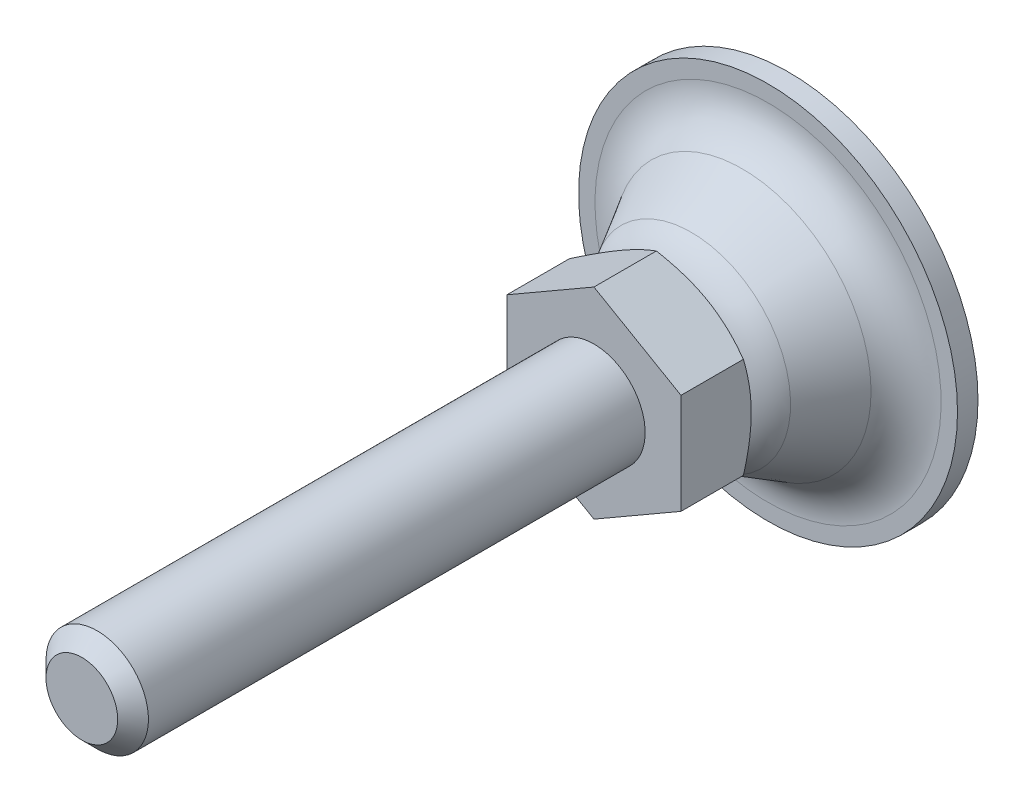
ISO-10303-21;
HEADER;
FILE_DESCRIPTION(('STEP AP214'),'2;1');
FILE_NAME('part.step','',(''),(''),'','','');
FILE_SCHEMA(('AUTOMOTIVE_DESIGN { 1 0 10303 214 1 1 1 1 }'));
ENDSEC;
DATA;
#1=APPLICATION_CONTEXT('core data for automotive mechanical design processes');
#2=APPLICATION_PROTOCOL_DEFINITION('international standard','automotive_design',2000,#1);
#3=PRODUCT_CONTEXT('',#1,'mechanical');
#4=PRODUCT('Part','Part','',(#3));
#5=PRODUCT_RELATED_PRODUCT_CATEGORY('part','',(#4));
#6=PRODUCT_DEFINITION_FORMATION('','',#4);
#7=PRODUCT_DEFINITION_CONTEXT('part definition',#1,'design');
#8=PRODUCT_DEFINITION('design','',#6,#7);
#9=PRODUCT_DEFINITION_SHAPE('','',#8);
#10=(LENGTH_UNIT() NAMED_UNIT(*) SI_UNIT(.MILLI.,.METRE.));
#11=(NAMED_UNIT(*) PLANE_ANGLE_UNIT() SI_UNIT($,.RADIAN.));
#12=(NAMED_UNIT(*) SI_UNIT($,.STERADIAN.) SOLID_ANGLE_UNIT());
#13=UNCERTAINTY_MEASURE_WITH_UNIT(LENGTH_MEASURE(1.E-05),#10,'distance_accuracy_value','');
#14=(GEOMETRIC_REPRESENTATION_CONTEXT(3) GLOBAL_UNCERTAINTY_ASSIGNED_CONTEXT((#13)) GLOBAL_UNIT_ASSIGNED_CONTEXT((#10,
#11,#12)) REPRESENTATION_CONTEXT('',''));
#15=CARTESIAN_POINT('',(0.,0.,0.));
#16=DIRECTION('',(0.,0.,1.));
#17=DIRECTION('',(1.,0.,0.));
#18=AXIS2_PLACEMENT_3D('',#15,#16,#17);
#19=CARTESIAN_POINT('',(-9.25,16.0214699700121,1.99999918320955));
#20=DIRECTION('',(0.,0.,-1.));
#21=DIRECTION('',(-0.5,0.866025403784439,0.));
#22=AXIS2_PLACEMENT_3D('',#19,#20,#21);
#23=PLANE('',#22);
#24=CARTESIAN_POINT('',(0.,0.,1.99999918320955));
#25=DIRECTION('',(0.,0.,1.));
#26=DIRECTION('',(0.5,-0.866025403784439,0.));
#27=AXIS2_PLACEMENT_3D('',#24,#25,#26);
#28=CIRCLE('',#27,16.8976413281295);
#29=CARTESIAN_POINT('',(8.44882066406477,-14.633786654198,1.99999918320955));
#30=VERTEX_POINT('',#29);
#31=EDGE_CURVE('E108',#30,#30,#28,.T.);
#32=ORIENTED_EDGE('',*,*,#31,.F.);
#33=EDGE_LOOP('',(#32));
#34=FACE_BOUND('',#33,.T.);
#35=CARTESIAN_POINT('',(0.,0.,2.));
#36=DIRECTION('',(0.,0.,1.));
#37=DIRECTION('',(1.,0.,0.));
#38=AXIS2_PLACEMENT_3D('',#35,#36,#37);
#39=CIRCLE('',#38,18.5);
#40=CARTESIAN_POINT('',(18.5,0.,2.));
#41=VERTEX_POINT('',#40);
#42=EDGE_CURVE('E245',#41,#41,#39,.T.);
#43=ORIENTED_EDGE('',*,*,#42,.T.);
#44=EDGE_LOOP('',(#43));
#45=FACE_BOUND('',#44,.T.);
#46=ADVANCED_FACE('F14',(#34,#45),#23,.F.);
#47=CARTESIAN_POINT('',(0.,0.,19.));
#48=DIRECTION('',(0.,0.,1.));
#49=DIRECTION('',(0.5,-0.866025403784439,0.));
#50=AXIS2_PLACEMENT_3D('',#47,#48,#49);
#51=PLANE('',#50);
#52=DIRECTION('',(0.,1.,0.));
#53=VECTOR('',#52,1.);
#54=CARTESIAN_POINT('',(8.5,-4.90747728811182,19.));
#55=LINE('',#54,#53);
#56=CARTESIAN_POINT('',(8.5,-4.90747728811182,19.));
#57=VERTEX_POINT('',#56);
#58=CARTESIAN_POINT('',(8.5,4.90747728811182,19.));
#59=VERTEX_POINT('',#58);
#60=EDGE_CURVE('E179',#57,#59,#55,.T.);
#61=ORIENTED_EDGE('',*,*,#60,.T.);
#62=DIRECTION('',(-0.866025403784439,0.5,0.));
#63=VECTOR('',#62,1.);
#64=CARTESIAN_POINT('',(8.5,4.90747728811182,19.));
#65=LINE('',#64,#63);
#66=CARTESIAN_POINT('',(0.,9.81495457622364,19.));
#67=VERTEX_POINT('',#66);
#68=EDGE_CURVE('E181',#59,#67,#65,.T.);
#69=ORIENTED_EDGE('',*,*,#68,.T.);
#70=DIRECTION('',(-0.866025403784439,-0.5,0.));
#71=VECTOR('',#70,1.);
#72=CARTESIAN_POINT('',(0.,9.81495457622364,19.));
#73=LINE('',#72,#71);
#74=CARTESIAN_POINT('',(-8.5,4.90747728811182,19.));
#75=VERTEX_POINT('',#74);
#76=EDGE_CURVE('E183',#67,#75,#73,.T.);
#77=ORIENTED_EDGE('',*,*,#76,.T.);
#78=DIRECTION('',(0.,-1.,0.));
#79=VECTOR('',#78,1.);
#80=CARTESIAN_POINT('',(-8.5,4.90747728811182,19.));
#81=LINE('',#80,#79);
#82=CARTESIAN_POINT('',(-8.5,-4.90747728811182,19.));
#83=VERTEX_POINT('',#82);
#84=EDGE_CURVE('E185',#75,#83,#81,.T.);
#85=ORIENTED_EDGE('',*,*,#84,.T.);
#86=DIRECTION('',(0.866025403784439,-0.5,0.));
#87=VECTOR('',#86,1.);
#88=CARTESIAN_POINT('',(-8.5,-4.90747728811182,19.));
#89=LINE('',#88,#87);
#90=CARTESIAN_POINT('',(0.,-9.81495457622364,19.));
#91=VERTEX_POINT('',#90);
#92=EDGE_CURVE('E187',#83,#91,#89,.T.);
#93=ORIENTED_EDGE('',*,*,#92,.T.);
#94=DIRECTION('',(0.866025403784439,0.5,0.));
#95=VECTOR('',#94,1.);
#96=CARTESIAN_POINT('',(0.,-9.81495457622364,19.));
#97=LINE('',#96,#95);
#98=EDGE_CURVE('E37',#91,#57,#97,.T.);
#99=ORIENTED_EDGE('',*,*,#98,.T.);
#100=EDGE_LOOP('',(#61,#69,#77,#85,#93,#99));
#101=FACE_BOUND('',#100,.T.);
#102=CARTESIAN_POINT('',(0.,0.,19.));
#103=DIRECTION('',(0.,0.,1.));
#104=DIRECTION('',(0.5,-0.866025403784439,0.));
#105=AXIS2_PLACEMENT_3D('',#102,#103,#104);
#106=CIRCLE('',#105,5.);
#107=CARTESIAN_POINT('',(2.5,-4.3301270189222,19.));
#108=VERTEX_POINT('',#107);
#109=EDGE_CURVE('E243',#108,#108,#106,.T.);
#110=ORIENTED_EDGE('',*,*,#109,.F.);
#111=EDGE_LOOP('',(#110));
#112=FACE_BOUND('',#111,.T.);
#113=ADVANCED_FACE('F188',(#101,#112),#51,.T.);
#114=CARTESIAN_POINT('',(0.,0.,12.));
#115=DIRECTION('',(0.,0.,1.));
#116=DIRECTION('',(0.5,-0.866025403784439,0.));
#117=AXIS2_PLACEMENT_3D('',#114,#115,#116);
#118=PLANE('',#117);
#119=CARTESIAN_POINT('',(0.,0.,12.));
#120=DIRECTION('',(0.,0.,1.));
#121=DIRECTION('',(0.5,-0.866025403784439,0.));
#122=AXIS2_PLACEMENT_3D('',#119,#120,#121);
#123=CIRCLE('',#122,5.36011171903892);
#124=CARTESIAN_POINT('',(2.68005585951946,-4.64199291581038,12.));
#125=VERTEX_POINT('',#124);
#126=EDGE_CURVE('E73',#125,#125,#123,.T.);
#127=ORIENTED_EDGE('',*,*,#126,.T.);
#128=EDGE_LOOP('',(#127));
#129=FACE_BOUND('',#128,.T.);
#130=CARTESIAN_POINT('',(0.,0.,12.));
#131=DIRECTION('',(0.,0.,1.));
#132=DIRECTION('',(0.5,-0.866025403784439,0.));
#133=AXIS2_PLACEMENT_3D('',#130,#131,#132);
#134=CIRCLE('',#133,8.25);
#135=CARTESIAN_POINT('',(4.125,-7.14470958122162,12.));
#136=VERTEX_POINT('',#135);
#137=EDGE_CURVE('E84',#136,#136,#134,.T.);
#138=ORIENTED_EDGE('',*,*,#137,.F.);
#139=EDGE_LOOP('',(#138));
#140=FACE_BOUND('',#139,.T.);
#141=ADVANCED_FACE('F125',(#129,#140),#118,.F.);
#142=CARTESIAN_POINT('',(0.,0.,7.));
#143=DIRECTION('',(0.,0.,1.));
#144=DIRECTION('',(0.5,-0.866025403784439,0.));
#145=AXIS2_PLACEMENT_3D('',#142,#143,#144);
#146=TOROIDAL_SURFACE('',#145,5.36011171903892,5.);
#147=ORIENTED_EDGE('',*,*,#126,.F.);
#148=EDGE_LOOP('',(#147));
#149=FACE_BOUND('',#148,.T.);
#150=CARTESIAN_POINT('',(0.,0.,9.49382979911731));
#151=DIRECTION('',(0.,0.,1.));
#152=DIRECTION('',(0.5,-0.866025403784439,0.));
#153=AXIS2_PLACEMENT_3D('',#150,#151,#152);
#154=CIRCLE('',#153,9.69379524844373);
#155=CARTESIAN_POINT('',(4.84689762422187,-8.39507294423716,9.49382979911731));
#156=VERTEX_POINT('',#155);
#157=EDGE_CURVE('E102',#156,#156,#154,.T.);
#158=ORIENTED_EDGE('',*,*,#157,.T.);
#159=EDGE_LOOP('',(#158));
#160=FACE_BOUND('',#159,.T.);
#161=ADVANCED_FACE('F214',(#149,#160),#146,.T.);
#162=CARTESIAN_POINT('',(0.,0.,6.99999918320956));
#163=DIRECTION('',(0.,0.,1.));
#164=DIRECTION('',(0.5,-0.866025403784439,0.));
#165=AXIS2_PLACEMENT_3D('',#162,#163,#164);
#166=TOROIDAL_SURFACE('',#165,16.8976413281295,5.);
#167=CARTESIAN_POINT('',(0.,0.,4.50616938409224));
#168=DIRECTION('',(0.,0.,1.));
#169=DIRECTION('',(0.5,-0.866025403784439,0.));
#170=AXIS2_PLACEMENT_3D('',#167,#168,#169);
#171=CIRCLE('',#170,12.5639577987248);
#172=CARTESIAN_POINT('',(6.28197889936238,-10.8807066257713,4.50616938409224));
#173=VERTEX_POINT('',#172);
#174=EDGE_CURVE('E105',#173,#173,#171,.T.);
#175=ORIENTED_EDGE('',*,*,#174,.F.);
#176=EDGE_LOOP('',(#175));
#177=FACE_BOUND('',#176,.T.);
#178=ORIENTED_EDGE('',*,*,#31,.T.);
#179=EDGE_LOOP('',(#178));
#180=FACE_BOUND('',#179,.T.);
#181=ADVANCED_FACE('F213',(#177,#180),#166,.F.);
#182=CARTESIAN_POINT('',(0.,0.,4.50616938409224));
#183=DIRECTION('',(0.,0.,-1.));
#184=DIRECTION('',(-0.5,0.866025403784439,0.));
#185=AXIS2_PLACEMENT_3D('',#182,#183,#184);
#186=CONICAL_SURFACE('',#185,12.5639577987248,0.522174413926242);
#187=ORIENTED_EDGE('',*,*,#157,.F.);
#188=EDGE_LOOP('',(#187));
#189=FACE_BOUND('',#188,.T.);
#190=ORIENTED_EDGE('',*,*,#174,.T.);
#191=EDGE_LOOP('',(#190));
#192=FACE_BOUND('',#191,.T.);
#193=ADVANCED_FACE('F172',(#189,#192),#186,.T.);
#194=CARTESIAN_POINT('',(0.,0.,14.056761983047));
#195=DIRECTION('',(0.,0.,1.));
#196=DIRECTION('',(0.5,-0.866025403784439,0.));
#197=AXIS2_PLACEMENT_3D('',#194,#195,#196);
#198=CONICAL_SURFACE('',#197,11.8124162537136,1.0471975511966);
#199=ORIENTED_EDGE('',*,*,#137,.T.);
#200=EDGE_LOOP('',(#199));
#201=FACE_BOUND('',#200,.T.);
#202=CARTESIAN_POINT('',(8.5,4.9077082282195,12.9035936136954));
#203=CARTESIAN_POINT('',(8.5,4.69196487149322,12.8413237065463));
#204=CARTESIAN_POINT('',(8.5,4.47541714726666,12.7818798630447));
#205=CARTESIAN_POINT('',(8.5,4.04056304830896,12.6694226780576));
#206=CARTESIAN_POINT('',(8.5,3.82225595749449,12.6164121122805));
#207=CARTESIAN_POINT('',(8.5,3.1638393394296,12.4680709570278));
#208=CARTESIAN_POINT('',(8.5,2.72113075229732,12.3836964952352));
#209=CARTESIAN_POINT('',(8.5,2.05862591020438,12.2847575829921));
#210=CARTESIAN_POINT('',(8.5,1.84080885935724,12.2565727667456));
#211=CARTESIAN_POINT('',(8.5,1.40418973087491,12.2093116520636));
#212=CARTESIAN_POINT('',(8.5,1.1853877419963,12.1902345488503));
#213=CARTESIAN_POINT('',(8.5,0.747407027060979,12.1616723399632));
#214=CARTESIAN_POINT('',(8.5,0.528229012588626,12.1521763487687));
#215=CARTESIAN_POINT('',(8.5,0.0896705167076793,12.1429799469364));
#216=CARTESIAN_POINT('',(8.5,-0.129709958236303,12.1432792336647));
#217=CARTESIAN_POINT('',(8.5,-0.539849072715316,12.1529920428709));
#218=CARTESIAN_POINT('',(8.5,-0.730636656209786,12.1612207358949));
#219=CARTESIAN_POINT('',(8.5,-1.11176497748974,12.1849268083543));
#220=CARTESIAN_POINT('',(8.5,-1.30210568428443,12.2004046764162));
#221=CARTESIAN_POINT('',(8.5,-1.87239091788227,12.257346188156));
#222=CARTESIAN_POINT('',(8.5,-2.25132599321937,12.309310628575));
#223=CARTESIAN_POINT('',(8.5,-3.01321579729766,12.4392225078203));
#224=CARTESIAN_POINT('',(8.5,-3.39607329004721,12.5177206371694));
#225=CARTESIAN_POINT('',(8.5,-4.15607888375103,12.69587890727));
#226=CARTESIAN_POINT('',(8.5,-4.53323671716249,12.7954972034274));
#227=CARTESIAN_POINT('',(8.5,-4.9077082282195,12.9035936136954));
#228=B_SPLINE_CURVE_WITH_KNOTS('',3,(#202,#203,#204,#205,#206,#207,#208,#209,#210,#211,#212,
#213,#214,#215,#216,#217,#218,#219,#220,#221,#222,#223,#224,#225,#226,#227),.UNSPECIFIED.,.F.,
.F.,(4,2,2,2,2,2,2,2,2,2,2,2,4),(0.,0.673596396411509,1.34748239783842,2.69805431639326,
3.35679995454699,4.01548737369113,4.67342558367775,5.33134346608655,5.9040955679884,
6.47688628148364,7.62328361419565,8.79510569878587,9.96462743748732),.UNSPECIFIED.);
#229=CARTESIAN_POINT('',(8.5,4.90747728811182,12.9035269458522));
#230=VERTEX_POINT('',#229);
#231=CARTESIAN_POINT('',(8.5,-4.90747728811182,12.9035269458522));
#232=VERTEX_POINT('',#231);
#233=EDGE_CURVE('E29',#230,#232,#228,.T.);
#234=ORIENTED_EDGE('',*,*,#233,.T.);
#235=CARTESIAN_POINT('',(-7.14326647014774,-13.9391213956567,16.2798199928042));
#236=CARTESIAN_POINT('',(-6.82194425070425,-13.7536059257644,16.0999425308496));
#237=CARTESIAN_POINT('',(-6.49988196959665,-13.5676631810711,15.9217974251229));
#238=CARTESIAN_POINT('',(-5.85388362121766,-13.1946958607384,15.5699467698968));
#239=CARTESIAN_POINT('',(-5.52994726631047,-13.0076711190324,15.3962419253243));
#240=CARTESIAN_POINT('',(-4.87812715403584,-12.6313426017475,15.0533671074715));
#241=CARTESIAN_POINT('',(-4.55023149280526,-12.4420319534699,14.8842272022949));
#242=CARTESIAN_POINT('',(-3.89182428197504,-12.0619003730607,14.5529043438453));
#243=CARTESIAN_POINT('',(-3.56131285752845,-11.8710795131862,14.390721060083));
#244=CARTESIAN_POINT('',(-2.8865671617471,-11.4815149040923,14.0701215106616));
#245=CARTESIAN_POINT('',(-2.54223100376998,-11.2827123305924,13.9119895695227));
#246=CARTESIAN_POINT('',(-1.84952262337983,-10.8827769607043,13.6077574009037));
#247=CARTESIAN_POINT('',(-1.50114995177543,-10.6816439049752,13.4616585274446));
#248=CARTESIAN_POINT('',(-0.800469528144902,-10.2771058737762,13.1853475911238));
#249=CARTESIAN_POINT('',(-0.448171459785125,-10.0737064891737,13.0551031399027));
#250=CARTESIAN_POINT('',(0.261465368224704,-9.66399747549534,12.8146959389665));
#251=CARTESIAN_POINT('',(0.618802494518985,-9.45768878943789,12.7045268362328));
#252=CARTESIAN_POINT('',(1.33680036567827,-9.0431525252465,12.5101667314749));
#253=CARTESIAN_POINT('',(1.69743191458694,-8.83494180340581,12.4258358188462));
#254=CARTESIAN_POINT('',(2.2416450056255,-8.52074022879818,12.3223820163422));
#255=CARTESIAN_POINT('',(2.42360720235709,-8.41568430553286,12.2917364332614));
#256=CARTESIAN_POINT('',(2.78842828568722,-8.20505475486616,12.2387278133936));
#257=CARTESIAN_POINT('',(2.97128708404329,-8.09948117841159,12.2163639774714));
#258=CARTESIAN_POINT('',(3.33527756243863,-7.88933117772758,12.1806435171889));
#259=CARTESIAN_POINT('',(3.51640089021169,-7.78475957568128,12.1671738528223));
#260=CARTESIAN_POINT('',(3.87897840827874,-7.57542534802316,12.1490889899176));
#261=CARTESIAN_POINT('',(4.06043259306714,-7.47066272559,12.1444736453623));
#262=CARTESIAN_POINT('',(4.42334771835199,-7.2611335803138,12.1442074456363));
#263=CARTESIAN_POINT('',(4.6048086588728,-7.15636705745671,12.1485566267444));
#264=CARTESIAN_POINT('',(4.96741117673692,-6.94701839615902,12.1661136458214));
#265=CARTESIAN_POINT('',(5.14855273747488,-6.84243626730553,12.1793219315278));
#266=CARTESIAN_POINT('',(5.58458372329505,-6.59069366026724,12.2215001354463));
#267=CARTESIAN_POINT('',(5.83917140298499,-6.44370739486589,12.2547178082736));
#268=CARTESIAN_POINT('',(6.34643025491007,-6.15084136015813,12.336834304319));
#269=CARTESIAN_POINT('',(6.59910115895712,-6.00496174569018,12.3857352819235));
#270=CARTESIAN_POINT('',(7.35396505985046,-5.56914086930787,12.5533675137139));
#271=CARTESIAN_POINT('',(7.85272201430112,-5.28118340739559,12.6929966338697));
#272=CARTESIAN_POINT('',(8.5984640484,-4.85062904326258,12.9347361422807));
#273=CARTESIAN_POINT('',(8.8493257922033,-4.70579394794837,13.0218147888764));
#274=CARTESIAN_POINT('',(9.34861215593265,-4.41753083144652,13.2049195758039));
#275=CARTESIAN_POINT('',(9.59703675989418,-4.274102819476,13.3009457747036));
#276=CARTESIAN_POINT('',(10.0915285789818,-3.98860783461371,13.5004130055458));
#277=CARTESIAN_POINT('',(10.3375965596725,-3.84654041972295,13.603851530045));
#278=CARTESIAN_POINT('',(10.8276994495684,-3.56357938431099,13.8169360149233));
#279=CARTESIAN_POINT('',(11.0717343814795,-3.42268575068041,13.9265819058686));
#280=CARTESIAN_POINT('',(11.6431211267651,-3.09279545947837,14.1903430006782));
#281=CARTESIAN_POINT('',(11.9697339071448,-2.90422548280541,14.3465887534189));
#282=CARTESIAN_POINT('',(12.6202200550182,-2.52866713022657,14.6665283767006));
#283=CARTESIAN_POINT('',(12.9440932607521,-2.34167884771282,14.8302226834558));
#284=CARTESIAN_POINT('',(13.5896047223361,-1.9689926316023,15.1635818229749));
#285=CARTESIAN_POINT('',(13.911242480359,-1.7832949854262,15.3332479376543));
#286=CARTESIAN_POINT('',(14.5525826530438,-1.41301706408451,15.6773581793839));
#287=CARTESIAN_POINT('',(14.8722851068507,-1.22843676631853,15.8518022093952));
#288=CARTESIAN_POINT('',(15.510412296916,-0.860013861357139,16.2047691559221));
#289=CARTESIAN_POINT('',(15.8288353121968,-0.676172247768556,16.3832962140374));
#290=CARTESIAN_POINT('',(16.4643165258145,-0.309276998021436,16.7435631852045));
#291=CARTESIAN_POINT('',(16.7813747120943,-0.126223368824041,16.925303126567));
#292=CARTESIAN_POINT('',(17.7307434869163,0.421894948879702,17.4744481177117));
#293=CARTESIAN_POINT('',(18.3613310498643,0.785964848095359,17.8458244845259));
#294=CARTESIAN_POINT('',(19.5671290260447,1.48213263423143,18.5650147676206));
#295=CARTESIAN_POINT('',(20.142605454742,1.81438410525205,18.9122366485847));
#296=CARTESIAN_POINT('',(21.2914143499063,2.47764923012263,19.6114287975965));
#297=CARTESIAN_POINT('',(21.8647467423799,2.80866284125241,19.9633992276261));
#298=CARTESIAN_POINT('',(23.00833933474,3.46891633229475,20.670098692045));
#299=CARTESIAN_POINT('',(23.5786036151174,3.79815856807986,21.0248189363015));
#300=CARTESIAN_POINT('',(24.7177587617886,4.45585009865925,21.7371045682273));
#301=CARTESIAN_POINT('',(25.28664970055,4.78429943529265,22.0946698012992));
#302=CARTESIAN_POINT('',(25.8550339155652,5.11245621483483,22.4532986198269));
#303=B_SPLINE_CURVE_WITH_KNOTS('',3,(#235,#236,#237,#238,#239,#240,#241,#242,#243,#244,#245,
#246,#247,#248,#249,#250,#251,#252,#253,#254,#255,#256,#257,#258,#259,#260,#261,#262,#263,#264,
#265,#266,#267,#268,#269,#270,#271,#272,#273,#274,#275,#276,#277,#278,#279,#280,#281,#282,#283,
#284,#285,#286,#287,#288,#289,#290,#291,#292,#293,#294,#295,#296,#297,#298,#299,#300,#301,#302),
.UNSPECIFIED.,.F.,.F.,(4,2,2,2,2,2,2,2,2,2,2,2,2,2,2,2,2,2,2,2,2,2,2,2,2,2,2,2,2,2,2,2,2,4),(0.,
1.23701916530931,2.47423351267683,3.71822790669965,4.96216313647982,6.24570205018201,
7.52938519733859,8.81040031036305,10.0910093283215,11.3645561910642,12.0014235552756,
12.6382294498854,13.2667775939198,13.895315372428,14.5238556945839,15.1524277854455,
16.039455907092,16.9266059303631,18.7019009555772,19.6092533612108,20.5166117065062,
21.4236645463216,22.3307072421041,23.5552735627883,24.7799116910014,26.0048143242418,
27.2296920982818,28.4558728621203,29.6820644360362,32.1341292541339,34.3833630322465,
36.6326737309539,38.8765143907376,41.120233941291),.UNSPECIFIED.);
#304=CARTESIAN_POINT('',(0.,-9.81495457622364,12.9035269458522));
#305=VERTEX_POINT('',#304);
#306=EDGE_CURVE('E65',#232,#305,#303,.F.);
#307=ORIENTED_EDGE('',*,*,#306,.T.);
#308=CARTESIAN_POINT('',(0.000200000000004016,-9.81507004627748,12.9035936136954));
#309=CARTESIAN_POINT('',(-0.186639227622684,-9.70719836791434,12.8413237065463));
#310=CARTESIAN_POINT('',(-0.374175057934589,-9.59892450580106,12.7818798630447));
#311=CARTESIAN_POINT('',(-0.750769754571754,-9.38149745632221,12.6694226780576));
#312=CARTESIAN_POINT('',(-0.939829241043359,-9.27234391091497,12.6164121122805));
#313=CARTESIAN_POINT('',(-1.51003475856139,-8.94313560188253,12.4680709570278));
#314=CARTESIAN_POINT('',(-1.89343164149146,-8.72178130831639,12.3836964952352));
#315=CARTESIAN_POINT('',(-2.46717766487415,-8.39052888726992,12.2847575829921));
#316=CARTESIAN_POINT('',(-2.65581276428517,-8.28162036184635,12.2565727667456));
#317=CARTESIAN_POINT('',(-3.0339360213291,-8.06331079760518,12.2093116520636));
#318=CARTESIAN_POINT('',(-3.22342410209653,-7.95390980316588,12.1902345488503));
#319=CARTESIAN_POINT('',(-3.60272652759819,-7.73491944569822,12.1616723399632));
#320=CARTESIAN_POINT('',(-3.79254025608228,-7.62533043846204,12.1521763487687));
#321=CARTESIAN_POINT('',(-4.17234305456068,-7.40605119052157,12.1429799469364));
#322=CARTESIAN_POINT('',(-4.36233211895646,-7.29636095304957,12.1432792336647));
#323=CARTESIAN_POINT('',(-4.71752301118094,-7.09129139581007,12.1529920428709));
#324=CARTESIAN_POINT('',(-4.88274990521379,-6.99589760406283,12.1612207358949));
#325=CARTESIAN_POINT('',(-5.21281671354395,-6.80533344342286,12.1849268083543));
#326=CARTESIAN_POINT('',(-5.37765660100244,-6.71016309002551,12.2004046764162));
#327=CARTESIAN_POINT('',(-5.87153810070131,-6.42502047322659,12.257346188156));
#328=CARTESIAN_POINT('',(-6.19970550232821,-6.23555293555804,12.309310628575));
#329=CARTESIAN_POINT('',(-6.85952142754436,-5.8546080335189,12.4392225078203));
#330=CARTESIAN_POINT('',(-7.19108574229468,-5.66317928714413,12.5177206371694));
#331=CARTESIAN_POINT('',(-7.84926989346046,-5.28317649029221,12.69587890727));
#332=CARTESIAN_POINT('',(-8.17589815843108,-5.09459757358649,12.7954972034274));
#333=CARTESIAN_POINT('',(-8.5002,-4.90736181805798,12.9035936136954));
#334=B_SPLINE_CURVE_WITH_KNOTS('',3,(#308,#309,#310,#311,#312,#313,#314,#315,#316,#317,#318,
#319,#320,#321,#322,#323,#324,#325,#326,#327,#328,#329,#330,#331,#332,#333),.UNSPECIFIED.,.F.,
.F.,(4,2,2,2,2,2,2,2,2,2,2,2,4),(0.,0.673596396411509,1.34748239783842,2.69805431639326,
3.356799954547,4.01548737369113,4.67342558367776,5.33134346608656,5.9040955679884,
6.47688628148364,7.62328361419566,8.79510569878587,9.96462743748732),.UNSPECIFIED.);
#335=CARTESIAN_POINT('',(-8.5,-4.90747728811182,12.9035269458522));
#336=VERTEX_POINT('',#335);
#337=EDGE_CURVE('E68',#305,#336,#334,.T.);
#338=ORIENTED_EDGE('',*,*,#337,.T.);
#339=CARTESIAN_POINT('',(-8.5,-4.9077082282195,12.9035936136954));
#340=CARTESIAN_POINT('',(-8.5,-4.69196487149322,12.8413237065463));
#341=CARTESIAN_POINT('',(-8.5,-4.47541714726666,12.7818798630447));
#342=CARTESIAN_POINT('',(-8.5,-4.04056304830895,12.6694226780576));
#343=CARTESIAN_POINT('',(-8.5,-3.82225595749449,12.6164121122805));
#344=CARTESIAN_POINT('',(-8.5,-3.1638393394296,12.4680709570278));
#345=CARTESIAN_POINT('',(-8.5,-2.72113075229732,12.3836964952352));
#346=CARTESIAN_POINT('',(-8.5,-2.05862591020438,12.2847575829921));
#347=CARTESIAN_POINT('',(-8.5,-1.84080885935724,12.2565727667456));
#348=CARTESIAN_POINT('',(-8.5,-1.40418973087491,12.2093116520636));
#349=CARTESIAN_POINT('',(-8.5,-1.1853877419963,12.1902345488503));
#350=CARTESIAN_POINT('',(-8.5,-0.747407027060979,12.1616723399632));
#351=CARTESIAN_POINT('',(-8.5,-0.528229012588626,12.1521763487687));
#352=CARTESIAN_POINT('',(-8.5,-0.0896705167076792,12.1429799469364));
#353=CARTESIAN_POINT('',(-8.5,0.129709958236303,12.1432792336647));
#354=CARTESIAN_POINT('',(-8.5,0.539849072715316,12.1529920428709));
#355=CARTESIAN_POINT('',(-8.5,0.730636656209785,12.1612207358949));
#356=CARTESIAN_POINT('',(-8.5,1.11176497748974,12.1849268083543));
#357=CARTESIAN_POINT('',(-8.5,1.30210568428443,12.2004046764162));
#358=CARTESIAN_POINT('',(-8.5,1.87239091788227,12.257346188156));
#359=CARTESIAN_POINT('',(-8.5,2.25132599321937,12.309310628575));
#360=CARTESIAN_POINT('',(-8.5,3.01321579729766,12.4392225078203));
#361=CARTESIAN_POINT('',(-8.5,3.3960732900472,12.5177206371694));
#362=CARTESIAN_POINT('',(-8.5,4.15607888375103,12.69587890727));
#363=CARTESIAN_POINT('',(-8.5,4.53323671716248,12.7954972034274));
#364=CARTESIAN_POINT('',(-8.5,4.90770822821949,12.9035936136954));
#365=B_SPLINE_CURVE_WITH_KNOTS('',3,(#339,#340,#341,#342,#343,#344,#345,#346,#347,#348,#349,
#350,#351,#352,#353,#354,#355,#356,#357,#358,#359,#360,#361,#362,#363,#364),.UNSPECIFIED.,.F.,
.F.,(4,2,2,2,2,2,2,2,2,2,2,2,4),(0.,0.673596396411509,1.34748239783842,2.69805431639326,
3.35679995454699,4.01548737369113,4.67342558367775,5.33134346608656,5.9040955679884,
6.47688628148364,7.62328361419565,8.79510569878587,9.96462743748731),.UNSPECIFIED.);
#366=CARTESIAN_POINT('',(-8.5,4.90747728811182,12.9035269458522));
#367=VERTEX_POINT('',#366);
#368=EDGE_CURVE('E83',#336,#367,#365,.T.);
#369=ORIENTED_EDGE('',*,*,#368,.T.);
#370=CARTESIAN_POINT('',(-15.643266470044,0.7833104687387,16.2798199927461));
#371=CARTESIAN_POINT('',(-15.321944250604,0.968825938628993,16.099942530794));
#372=CARTESIAN_POINT('',(-14.9998819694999,1.15476868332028,15.9217974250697));
#373=CARTESIAN_POINT('',(-14.3538836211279,1.52773600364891,15.5699467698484));
#374=CARTESIAN_POINT('',(-14.0299472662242,1.71476074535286,15.3962419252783));
#375=CARTESIAN_POINT('',(-13.3781271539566,2.09108926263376,15.0533671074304));
#376=CARTESIAN_POINT('',(-13.0502314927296,2.28039991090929,14.8842272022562));
#377=CARTESIAN_POINT('',(-12.3918242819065,2.66053149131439,14.5529043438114));
#378=CARTESIAN_POINT('',(-12.0613128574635,2.85135235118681,14.3907210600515));
#379=CARTESIAN_POINT('',(-11.3865671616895,3.24091696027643,14.0701215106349));
#380=CARTESIAN_POINT('',(-11.0422310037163,3.43971953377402,13.9119895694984));
#381=CARTESIAN_POINT('',(-10.3495226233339,3.83965490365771,13.6077574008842));
#382=CARTESIAN_POINT('',(-10.0011499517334,4.04078795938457,13.4616585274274));
#383=CARTESIAN_POINT('',(-9.30046952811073,4.445325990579,13.1853475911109));
#384=CARTESIAN_POINT('',(-8.94817145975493,4.64872537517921,13.055103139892));
#385=CARTESIAN_POINT('',(-8.23853463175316,5.0584343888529,12.8146959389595));
#386=CARTESIAN_POINT('',(-7.88119750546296,5.26474307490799,12.7045268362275));
#387=CARTESIAN_POINT('',(-7.16319963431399,5.67927933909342,12.5101667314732));
#388=CARTESIAN_POINT('',(-6.80256808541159,5.8874900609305,12.4258358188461));
#389=CARTESIAN_POINT('',(-6.25835499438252,6.20169163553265,12.3223820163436));
#390=CARTESIAN_POINT('',(-6.07639279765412,6.30674755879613,12.2917364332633));
#391=CARTESIAN_POINT('',(-5.71157171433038,6.51737710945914,12.2387278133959));
#392=CARTESIAN_POINT('',(-5.52871291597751,6.62295068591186,12.2163639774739));
#393=CARTESIAN_POINT('',(-5.16472243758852,6.83310068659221,12.1806435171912));
#394=CARTESIAN_POINT('',(-4.9835991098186,6.93767228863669,12.1671738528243));
#395=CARTESIAN_POINT('',(-4.62102159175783,7.14700651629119,12.1490889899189));
#396=CARTESIAN_POINT('',(-4.43956740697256,7.25176913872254,12.144473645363));
#397=CARTESIAN_POINT('',(-4.07665228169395,7.46129828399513,12.1442074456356));
#398=CARTESIAN_POINT('',(-3.89519134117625,7.56606480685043,12.1485566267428));
#399=CARTESIAN_POINT('',(-3.5325888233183,7.77541346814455,12.1661136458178));
#400=CARTESIAN_POINT('',(-3.35144726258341,7.87999559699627,12.1793219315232));
#401=CARTESIAN_POINT('',(-2.91541627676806,8.13173820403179,12.2215001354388));
#402=CARTESIAN_POINT('',(-2.66082859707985,8.27872446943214,12.2547178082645));
#403=CARTESIAN_POINT('',(-2.15356974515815,8.57159050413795,12.3368343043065));
#404=CARTESIAN_POINT('',(-1.90089884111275,8.71747011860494,12.3857352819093));
#405=CARTESIAN_POINT('',(-1.14603494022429,9.15329099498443,12.5533675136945));
#406=CARTESIAN_POINT('',(-0.647277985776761,9.44124845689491,12.6929966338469));
#407=CARTESIAN_POINT('',(0.0984640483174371,9.87180282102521,12.9347361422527));
#408=CARTESIAN_POINT('',(0.349325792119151,10.0166379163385,13.0218147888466));
#409=CARTESIAN_POINT('',(0.848612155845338,10.3049010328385,13.2049195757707));
#410=CARTESIAN_POINT('',(1.09703675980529,10.4483290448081,13.3009457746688));
#411=CARTESIAN_POINT('',(1.59152857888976,10.7338240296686,13.5004130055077));
#412=CARTESIAN_POINT('',(1.83759655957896,10.8758914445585,13.6038515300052));
#413=CARTESIAN_POINT('',(2.32769944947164,11.1588524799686,13.8169360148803));
#414=CARTESIAN_POINT('',(2.57173438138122,11.2997461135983,13.9265819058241));
#415=CARTESIAN_POINT('',(3.14312112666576,11.6296364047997,14.1903430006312));
#416=CARTESIAN_POINT('',(3.46973390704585,11.8182063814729,14.3465887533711));
#417=CARTESIAN_POINT('',(4.12022005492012,12.1937647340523,14.6665283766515));
#418=CARTESIAN_POINT('',(4.44409326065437,12.3807530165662,14.830222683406));
#419=CARTESIAN_POINT('',(5.08960472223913,12.7534392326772,15.1635818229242));
#420=CARTESIAN_POINT('',(5.41124248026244,12.9391368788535,15.3332479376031));
#421=CARTESIAN_POINT('',(6.05258265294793,13.3094148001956,15.6773581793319));
#422=CARTESIAN_POINT('',(6.37228510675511,13.4939950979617,15.8518022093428));
#423=CARTESIAN_POINT('',(7.01041229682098,13.8624180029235,16.2047691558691));
#424=CARTESIAN_POINT('',(7.32883531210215,14.0462596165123,16.3832962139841));
#425=CARTESIAN_POINT('',(7.96431652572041,14.4131548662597,16.7435631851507));
#426=CARTESIAN_POINT('',(8.28137471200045,14.5962084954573,16.9253031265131));
#427=CARTESIAN_POINT('',(9.23074348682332,15.1443268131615,17.4744481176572));
#428=CARTESIAN_POINT('',(9.86133104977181,15.5083967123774,17.8458244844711));
#429=CARTESIAN_POINT('',(11.0671290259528,16.2045644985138,18.5650147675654));
#430=CARTESIAN_POINT('',(11.6426054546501,16.5368159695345,18.9122366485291));
#431=CARTESIAN_POINT('',(12.7914143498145,17.2000810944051,19.6114287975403));
#432=CARTESIAN_POINT('',(13.3647467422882,17.5310947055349,19.9633992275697));
#433=CARTESIAN_POINT('',(14.5083393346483,18.1913481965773,20.6700986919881));
#434=CARTESIAN_POINT('',(15.0786036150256,18.5205904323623,21.0248189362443));
#435=CARTESIAN_POINT('',(16.2177587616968,19.1782819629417,21.7371045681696));
#436=CARTESIAN_POINT('',(16.7866497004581,19.506731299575,22.0946698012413));
#437=CARTESIAN_POINT('',(17.3550339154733,19.8348880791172,22.4532986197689));
#438=B_SPLINE_CURVE_WITH_KNOTS('',3,(#370,#371,#372,#373,#374,#375,#376,#377,#378,#379,#380,
#381,#382,#383,#384,#385,#386,#387,#388,#389,#390,#391,#392,#393,#394,#395,#396,#397,#398,#399,
#400,#401,#402,#403,#404,#405,#406,#407,#408,#409,#410,#411,#412,#413,#414,#415,#416,#417,#418,
#419,#420,#421,#422,#423,#424,#425,#426,#427,#428,#429,#430,#431,#432,#433,#434,#435,#436,#437),
.UNSPECIFIED.,.F.,.F.,(4,2,2,2,2,2,2,2,2,2,2,2,2,2,2,2,2,2,2,2,2,2,2,2,2,2,2,2,2,2,2,2,2,4),(0.,
1.23701916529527,2.47423351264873,3.71822790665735,4.96216313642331,6.24570205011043,
7.52938519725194,8.81040031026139,10.0910093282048,11.3645561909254,12.0014235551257,
12.6382294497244,13.2667775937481,13.8953153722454,14.5238556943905,15.1524277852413,
16.0394559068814,16.9266059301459,18.701900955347,19.6092533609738,20.5166117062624,
21.4236645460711,22.3307072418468,23.5552735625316,24.7799116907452,26.0048143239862,
27.2296920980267,28.4558728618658,29.6820644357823,32.1341292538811,34.3833630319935,
36.6326737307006,38.876514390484,41.1202339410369),.UNSPECIFIED.);
#439=CARTESIAN_POINT('',(0.,9.81495457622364,12.9035269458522));
#440=VERTEX_POINT('',#439);
#441=EDGE_CURVE('E144',#367,#440,#438,.T.);
#442=ORIENTED_EDGE('',*,*,#441,.T.);
#443=CARTESIAN_POINT('',(-0.000200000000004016,9.81507004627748,12.9035936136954));
#444=CARTESIAN_POINT('',(0.186639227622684,9.70719836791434,12.8413237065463));
#445=CARTESIAN_POINT('',(0.374175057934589,9.59892450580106,12.7818798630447));
#446=CARTESIAN_POINT('',(0.750769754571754,9.38149745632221,12.6694226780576));
#447=CARTESIAN_POINT('',(0.939829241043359,9.27234391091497,12.6164121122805));
#448=CARTESIAN_POINT('',(1.51003475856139,8.94313560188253,12.4680709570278));
#449=CARTESIAN_POINT('',(1.89343164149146,8.72178130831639,12.3836964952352));
#450=CARTESIAN_POINT('',(2.46717766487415,8.39052888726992,12.2847575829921));
#451=CARTESIAN_POINT('',(2.65581276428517,8.28162036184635,12.2565727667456));
#452=CARTESIAN_POINT('',(3.0339360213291,8.06331079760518,12.2093116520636));
#453=CARTESIAN_POINT('',(3.22342410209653,7.95390980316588,12.1902345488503));
#454=CARTESIAN_POINT('',(3.60272652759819,7.73491944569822,12.1616723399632));
#455=CARTESIAN_POINT('',(3.79254025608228,7.62533043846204,12.1521763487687));
#456=CARTESIAN_POINT('',(4.17234305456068,7.40605119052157,12.1429799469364));
#457=CARTESIAN_POINT('',(4.36233211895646,7.29636095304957,12.1432792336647));
#458=CARTESIAN_POINT('',(4.71752301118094,7.09129139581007,12.1529920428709));
#459=CARTESIAN_POINT('',(4.88274990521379,6.99589760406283,12.1612207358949));
#460=CARTESIAN_POINT('',(5.21281671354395,6.80533344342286,12.1849268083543));
#461=CARTESIAN_POINT('',(5.37765660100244,6.71016309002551,12.2004046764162));
#462=CARTESIAN_POINT('',(5.87153810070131,6.42502047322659,12.257346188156));
#463=CARTESIAN_POINT('',(6.19970550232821,6.23555293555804,12.309310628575));
#464=CARTESIAN_POINT('',(6.85952142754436,5.8546080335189,12.4392225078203));
#465=CARTESIAN_POINT('',(7.19108574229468,5.66317928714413,12.5177206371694));
#466=CARTESIAN_POINT('',(7.84926989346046,5.28317649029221,12.69587890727));
#467=CARTESIAN_POINT('',(8.17589815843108,5.09459757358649,12.7954972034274));
#468=CARTESIAN_POINT('',(8.5002,4.90736181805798,12.9035936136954));
#469=B_SPLINE_CURVE_WITH_KNOTS('',3,(#443,#444,#445,#446,#447,#448,#449,#450,#451,#452,#453,
#454,#455,#456,#457,#458,#459,#460,#461,#462,#463,#464,#465,#466,#467,#468),.UNSPECIFIED.,.F.,
.F.,(4,2,2,2,2,2,2,2,2,2,2,2,4),(0.,0.673596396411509,1.34748239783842,2.69805431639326,
3.356799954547,4.01548737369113,4.67342558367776,5.33134346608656,5.9040955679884,
6.47688628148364,7.62328361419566,8.79510569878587,9.96462743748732),.UNSPECIFIED.);
#470=EDGE_CURVE('E150',#440,#230,#469,.T.);
#471=ORIENTED_EDGE('',*,*,#470,.T.);
#472=EDGE_LOOP('',(#234,#307,#338,#369,#442,#471));
#473=FACE_BOUND('',#472,.T.);
#474=ADVANCED_FACE('F67',(#201,#473),#198,.T.);
#475=CARTESIAN_POINT('',(0.,-9.81495457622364,19.));
#476=DIRECTION('',(-0.5,0.866025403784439,0.));
#477=DIRECTION('',(-0.866025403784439,-0.5,0.));
#478=AXIS2_PLACEMENT_3D('',#475,#476,#477);
#479=PLANE('',#478);
#480=ORIENTED_EDGE('',*,*,#306,.F.);
#481=DIRECTION('',(0.,0.,-1.));
#482=VECTOR('',#481,1.);
#483=CARTESIAN_POINT('',(8.5,-4.90747728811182,19.));
#484=LINE('',#483,#482);
#485=EDGE_CURVE('E87',#57,#232,#484,.T.);
#486=ORIENTED_EDGE('',*,*,#485,.F.);
#487=ORIENTED_EDGE('',*,*,#98,.F.);
#488=DIRECTION('',(0.,0.,-1.));
#489=VECTOR('',#488,1.);
#490=CARTESIAN_POINT('',(0.,-9.81495457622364,19.));
#491=LINE('',#490,#489);
#492=EDGE_CURVE('E80',#91,#305,#491,.T.);
#493=ORIENTED_EDGE('',*,*,#492,.T.);
#494=EDGE_LOOP('',(#480,#486,#487,#493));
#495=FACE_BOUND('',#494,.T.);
#496=ADVANCED_FACE('F86',(#495),#479,.F.);
#497=CARTESIAN_POINT('',(-8.5,-4.90747728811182,19.));
#498=DIRECTION('',(0.5,0.866025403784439,0.));
#499=DIRECTION('',(-0.866025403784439,0.5,0.));
#500=AXIS2_PLACEMENT_3D('',#497,#498,#499);
#501=PLANE('',#500);
#502=ORIENTED_EDGE('',*,*,#337,.F.);
#503=ORIENTED_EDGE('',*,*,#492,.F.);
#504=ORIENTED_EDGE('',*,*,#92,.F.);
#505=DIRECTION('',(0.,0.,-1.));
#506=VECTOR('',#505,1.);
#507=CARTESIAN_POINT('',(-8.5,-4.90747728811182,19.));
#508=LINE('',#507,#506);
#509=EDGE_CURVE('E82',#83,#336,#508,.T.);
#510=ORIENTED_EDGE('',*,*,#509,.T.);
#511=EDGE_LOOP('',(#502,#503,#504,#510));
#512=FACE_BOUND('',#511,.T.);
#513=ADVANCED_FACE('F78',(#512),#501,.F.);
#514=CARTESIAN_POINT('',(-8.5,4.90747728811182,19.));
#515=DIRECTION('',(1.,0.,0.));
#516=DIRECTION('',(0.,1.,0.));
#517=AXIS2_PLACEMENT_3D('',#514,#515,#516);
#518=PLANE('',#517);
#519=ORIENTED_EDGE('',*,*,#368,.F.);
#520=ORIENTED_EDGE('',*,*,#509,.F.);
#521=ORIENTED_EDGE('',*,*,#84,.F.);
#522=DIRECTION('',(0.,0.,-1.));
#523=VECTOR('',#522,1.);
#524=CARTESIAN_POINT('',(-8.5,4.90747728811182,19.));
#525=LINE('',#524,#523);
#526=EDGE_CURVE('E89',#75,#367,#525,.T.);
#527=ORIENTED_EDGE('',*,*,#526,.T.);
#528=EDGE_LOOP('',(#519,#520,#521,#527));
#529=FACE_BOUND('',#528,.T.);
#530=ADVANCED_FACE('F129',(#529),#518,.F.);
#531=CARTESIAN_POINT('',(0.,9.81495457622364,19.));
#532=DIRECTION('',(0.5,-0.866025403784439,0.));
#533=DIRECTION('',(0.866025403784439,0.5,0.));
#534=AXIS2_PLACEMENT_3D('',#531,#532,#533);
#535=PLANE('',#534);
#536=ORIENTED_EDGE('',*,*,#441,.F.);
#537=ORIENTED_EDGE('',*,*,#526,.F.);
#538=ORIENTED_EDGE('',*,*,#76,.F.);
#539=DIRECTION('',(0.,0.,-1.));
#540=VECTOR('',#539,1.);
#541=CARTESIAN_POINT('',(0.,9.81495457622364,19.));
#542=LINE('',#541,#540);
#543=EDGE_CURVE('E96',#67,#440,#542,.T.);
#544=ORIENTED_EDGE('',*,*,#543,.T.);
#545=EDGE_LOOP('',(#536,#537,#538,#544));
#546=FACE_BOUND('',#545,.T.);
#547=ADVANCED_FACE('F157',(#546),#535,.F.);
#548=CARTESIAN_POINT('',(8.5,4.90747728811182,19.));
#549=DIRECTION('',(-0.5,-0.866025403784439,0.));
#550=DIRECTION('',(0.866025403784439,-0.5,0.));
#551=AXIS2_PLACEMENT_3D('',#548,#549,#550);
#552=PLANE('',#551);
#553=ORIENTED_EDGE('',*,*,#470,.F.);
#554=ORIENTED_EDGE('',*,*,#543,.F.);
#555=ORIENTED_EDGE('',*,*,#68,.F.);
#556=DIRECTION('',(0.,0.,-1.));
#557=VECTOR('',#556,1.);
#558=CARTESIAN_POINT('',(8.5,4.90747728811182,19.));
#559=LINE('',#558,#557);
#560=EDGE_CURVE('E99',#59,#230,#559,.T.);
#561=ORIENTED_EDGE('',*,*,#560,.T.);
#562=EDGE_LOOP('',(#553,#554,#555,#561));
#563=FACE_BOUND('',#562,.T.);
#564=ADVANCED_FACE('F160',(#563),#552,.F.);
#565=CARTESIAN_POINT('',(8.5,-4.90747728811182,19.));
#566=DIRECTION('',(-1.,0.,0.));
#567=DIRECTION('',(0.,-1.,0.));
#568=AXIS2_PLACEMENT_3D('',#565,#566,#567);
#569=PLANE('',#568);
#570=ORIENTED_EDGE('',*,*,#233,.F.);
#571=ORIENTED_EDGE('',*,*,#560,.F.);
#572=ORIENTED_EDGE('',*,*,#60,.F.);
#573=ORIENTED_EDGE('',*,*,#485,.T.);
#574=EDGE_LOOP('',(#570,#571,#572,#573));
#575=FACE_BOUND('',#574,.T.);
#576=ADVANCED_FACE('F165',(#575),#569,.F.);
#577=CARTESIAN_POINT('',(0.,0.,69.));
#578=DIRECTION('',(0.,0.,-1.));
#579=DIRECTION('',(-0.5,0.866025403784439,0.));
#580=AXIS2_PLACEMENT_3D('',#577,#578,#579);
#581=CYLINDRICAL_SURFACE('',#580,5.);
#582=CARTESIAN_POINT('',(0.,0.,67.5));
#583=DIRECTION('',(0.,0.,1.));
#584=DIRECTION('',(0.5,-0.866025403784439,0.));
#585=AXIS2_PLACEMENT_3D('',#582,#583,#584);
#586=CIRCLE('',#585,5.);
#587=CARTESIAN_POINT('',(2.5,-4.3301270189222,67.5));
#588=VERTEX_POINT('',#587);
#589=EDGE_CURVE('E9',#588,#588,#586,.F.);
#590=ORIENTED_EDGE('',*,*,#589,.T.);
#591=EDGE_LOOP('',(#590));
#592=FACE_BOUND('',#591,.T.);
#593=ORIENTED_EDGE('',*,*,#109,.T.);
#594=EDGE_LOOP('',(#593));
#595=FACE_BOUND('',#594,.T.);
#596=ADVANCED_FACE('F170',(#592,#595),#581,.T.);
#597=CARTESIAN_POINT('',(0.,0.,69.));
#598=DIRECTION('',(0.,0.,1.));
#599=DIRECTION('',(0.5,-0.866025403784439,0.));
#600=AXIS2_PLACEMENT_3D('',#597,#598,#599);
#601=PLANE('',#600);
#602=CARTESIAN_POINT('',(0.,0.,69.));
#603=DIRECTION('',(0.,0.,1.));
#604=DIRECTION('',(0.5,-0.866025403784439,0.));
#605=AXIS2_PLACEMENT_3D('',#602,#603,#604);
#606=CIRCLE('',#605,3.5);
#607=CARTESIAN_POINT('',(1.75,-3.03108891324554,69.));
#608=VERTEX_POINT('',#607);
#609=EDGE_CURVE('E22',#608,#608,#606,.T.);
#610=ORIENTED_EDGE('',*,*,#609,.T.);
#611=EDGE_LOOP('',(#610));
#612=FACE_BOUND('',#611,.T.);
#613=ADVANCED_FACE('F267',(#612),#601,.T.);
#614=CARTESIAN_POINT('',(0.,0.,69.));
#615=DIRECTION('',(0.,0.,-1.));
#616=DIRECTION('',(-0.5,0.866025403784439,0.));
#617=AXIS2_PLACEMENT_3D('',#614,#615,#616);
#618=CONICAL_SURFACE('',#617,3.5,0.785398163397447);
#619=ORIENTED_EDGE('',*,*,#589,.F.);
#620=EDGE_LOOP('',(#619));
#621=FACE_BOUND('',#620,.T.);
#622=ORIENTED_EDGE('',*,*,#609,.F.);
#623=EDGE_LOOP('',(#622));
#624=FACE_BOUND('',#623,.T.);
#625=ADVANCED_FACE('F16',(#621,#624),#618,.T.);
#626=CARTESIAN_POINT('',(0.,0.,73.0240046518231));
#627=DIRECTION('',(0.,0.,1.));
#628=DIRECTION('',(1.,0.,0.));
#629=AXIS2_PLACEMENT_3D('',#626,#627,#628);
#630=CYLINDRICAL_SURFACE('',#629,18.5);
#631=ORIENTED_EDGE('',*,*,#42,.F.);
#632=EDGE_LOOP('',(#631));
#633=FACE_BOUND('',#632,.T.);
#634=CARTESIAN_POINT('',(0.,0.,0.));
#635=DIRECTION('',(0.,0.,1.));
#636=DIRECTION('',(1.,0.,0.));
#637=AXIS2_PLACEMENT_3D('',#634,#635,#636);
#638=CIRCLE('',#637,18.5);
#639=CARTESIAN_POINT('',(18.5,0.,0.));
#640=VERTEX_POINT('',#639);
#641=EDGE_CURVE('E249',#640,#640,#638,.T.);
#642=ORIENTED_EDGE('',*,*,#641,.T.);
#643=EDGE_LOOP('',(#642));
#644=FACE_BOUND('',#643,.T.);
#645=ADVANCED_FACE('F255',(#633,#644),#630,.T.);
#646=CARTESIAN_POINT('',(0.,0.,0.));
#647=DIRECTION('',(0.,0.,1.));
#648=DIRECTION('',(1.,0.,0.));
#649=AXIS2_PLACEMENT_3D('',#646,#647,#648);
#650=PLANE('',#649);
#651=ORIENTED_EDGE('',*,*,#641,.F.);
#652=EDGE_LOOP('',(#651));
#653=FACE_BOUND('',#652,.T.);
#654=ADVANCED_FACE('F257',(#653),#650,.F.);
#655=CLOSED_SHELL('',(#46,#113,#141,#161,#181,#193,#474,#496,#513,#530,#547,#564,#576,#596,#613,
#625,#645,#654));
#656=MANIFOLD_SOLID_BREP('B1',#655);
#657=ADVANCED_BREP_SHAPE_REPRESENTATION('',(#18,#656),#14);
#658=SHAPE_DEFINITION_REPRESENTATION(#9,#657);
ENDSEC;
END-ISO-10303-21;
